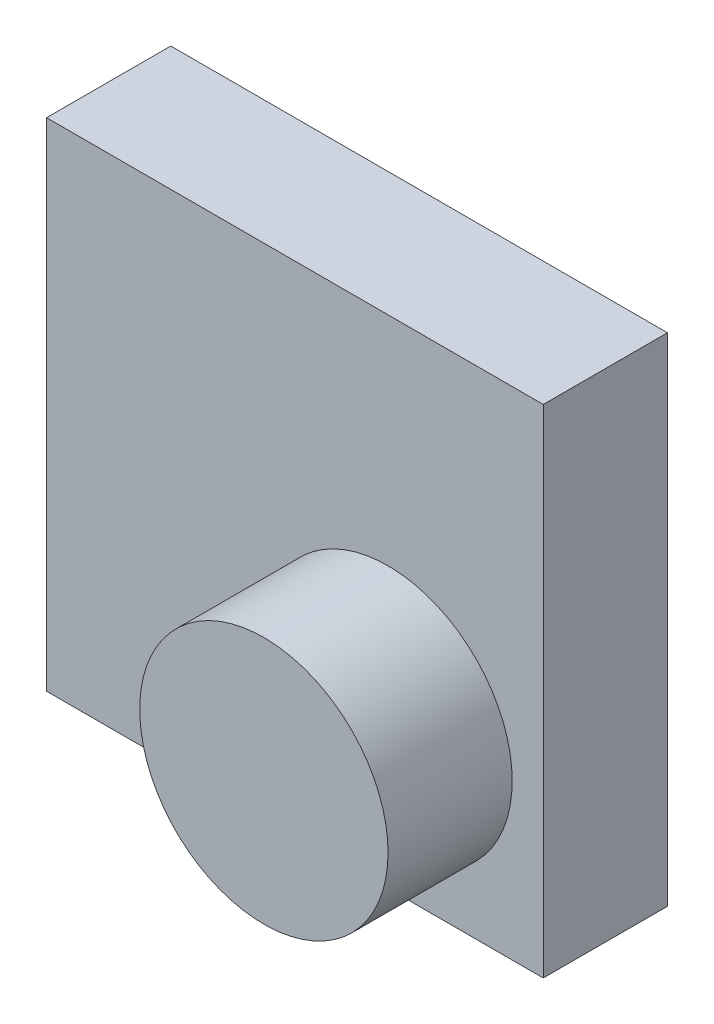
from build123d import *

# Parameters (mm, degrees)
SKETCH1_W           = 101.6
SKETCH1_H           = 101.6
BOSS_EXTRUDE1_DEPTH = 12.7
SKETCH3_R           = 25.4
BOSS_EXTRUDE2_DEPTH = 25.4


with BuildPart() as part:
    # Sketch1 → Boss-Extrude1 (new, symmetric)
    with BuildSketch(Plane.XY):
        Rectangle(SKETCH1_W, SKETCH1_H)
    extrude(amount=BOSS_EXTRUDE1_DEPTH, both=True)

    # Sketch3 → Boss-Extrude2 (add)
    with BuildSketch(Plane.XY.offset(12.7)):
        with Locations((19.05, -19.05)):
            Circle(SKETCH3_R)
    extrude(amount=BOSS_EXTRUDE2_DEPTH)


solid = part.part
